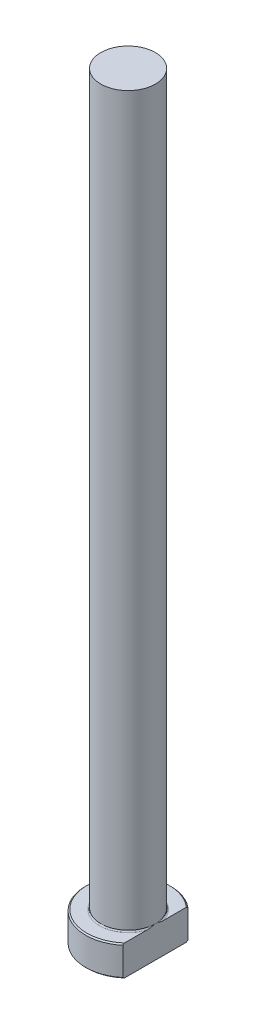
ISO-10303-21;
HEADER;
FILE_DESCRIPTION(('STEP AP214'),'2;1');
FILE_NAME('part.step','',(''),(''),'','','');
FILE_SCHEMA(('AUTOMOTIVE_DESIGN { 1 0 10303 214 1 1 1 1 }'));
ENDSEC;
DATA;
#1=APPLICATION_CONTEXT('core data for automotive mechanical design processes');
#2=APPLICATION_PROTOCOL_DEFINITION('international standard','automotive_design',2000,#1);
#3=PRODUCT_CONTEXT('',#1,'mechanical');
#4=PRODUCT('Part','Part','',(#3));
#5=PRODUCT_RELATED_PRODUCT_CATEGORY('part','',(#4));
#6=PRODUCT_DEFINITION_FORMATION('','',#4);
#7=PRODUCT_DEFINITION_CONTEXT('part definition',#1,'design');
#8=PRODUCT_DEFINITION('design','',#6,#7);
#9=PRODUCT_DEFINITION_SHAPE('','',#8);
#10=(LENGTH_UNIT() NAMED_UNIT(*) SI_UNIT(.MILLI.,.METRE.));
#11=(NAMED_UNIT(*) PLANE_ANGLE_UNIT() SI_UNIT($,.RADIAN.));
#12=(NAMED_UNIT(*) SI_UNIT($,.STERADIAN.) SOLID_ANGLE_UNIT());
#13=UNCERTAINTY_MEASURE_WITH_UNIT(LENGTH_MEASURE(1.E-05),#10,'distance_accuracy_value','');
#14=(GEOMETRIC_REPRESENTATION_CONTEXT(3) GLOBAL_UNCERTAINTY_ASSIGNED_CONTEXT((#13)) GLOBAL_UNIT_ASSIGNED_CONTEXT((#10,
#11,#12)) REPRESENTATION_CONTEXT('',''));
#15=CARTESIAN_POINT('',(0.,0.,0.));
#16=DIRECTION('',(0.,0.,1.));
#17=DIRECTION('',(1.,0.,0.));
#18=AXIS2_PLACEMENT_3D('',#15,#16,#17);
#19=CARTESIAN_POINT('',(0.,0.,0.));
#20=DIRECTION('',(0.,-1.,0.));
#21=DIRECTION('',(0.,0.,-1.));
#22=AXIS2_PLACEMENT_3D('',#19,#20,#21);
#23=PLANE('',#22);
#24=CARTESIAN_POINT('',(0.,0.,0.));
#25=DIRECTION('',(0.,-1.,0.));
#26=DIRECTION('',(0.,0.,-1.));
#27=AXIS2_PLACEMENT_3D('',#24,#25,#26);
#28=CIRCLE('',#27,6.8);
#29=CARTESIAN_POINT('',(4.49999999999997,0.,5.09803883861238));
#30=VERTEX_POINT('',#29);
#31=CARTESIAN_POINT('',(4.49999999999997,0.,-5.09803883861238));
#32=VERTEX_POINT('',#31);
#33=EDGE_CURVE('E98',#30,#32,#28,.T.);
#34=ORIENTED_EDGE('',*,*,#33,.T.);
#35=DIRECTION('',(0.,0.,1.));
#36=VECTOR('',#35,1.);
#37=CARTESIAN_POINT('',(4.49999999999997,0.,-5.36190264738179));
#38=LINE('',#37,#36);
#39=EDGE_CURVE('E83',#32,#30,#38,.T.);
#40=ORIENTED_EDGE('',*,*,#39,.T.);
#41=EDGE_LOOP('',(#34,#40));
#42=FACE_BOUND('',#41,.T.);
#43=ADVANCED_FACE('F32',(#42),#23,.T.);
#44=CARTESIAN_POINT('',(0.,259.958771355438,0.));
#45=DIRECTION('',(0.,1.,0.));
#46=DIRECTION('',(0.,0.,1.));
#47=AXIS2_PLACEMENT_3D('',#44,#45,#46);
#48=CYLINDRICAL_SURFACE('',#47,6.99999999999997);
#49=CARTESIAN_POINT('',(0.,4.80000000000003,0.));
#50=DIRECTION('',(0.,1.,0.));
#51=DIRECTION('',(0.,0.,1.));
#52=AXIS2_PLACEMENT_3D('',#49,#50,#51);
#53=CIRCLE('',#52,6.99999999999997);
#54=CARTESIAN_POINT('',(4.49999999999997,4.80000000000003,5.36190264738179));
#55=VERTEX_POINT('',#54);
#56=CARTESIAN_POINT('',(4.49999999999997,4.80000000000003,-5.36190264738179));
#57=VERTEX_POINT('',#56);
#58=EDGE_CURVE('E104',#55,#57,#53,.F.);
#59=ORIENTED_EDGE('',*,*,#58,.T.);
#60=DIRECTION('',(0.,-1.,0.));
#61=VECTOR('',#60,1.);
#62=CARTESIAN_POINT('',(4.49999999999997,125.,-5.36190264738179));
#63=LINE('',#62,#61);
#64=CARTESIAN_POINT('',(4.49999999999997,0.199999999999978,-5.36190264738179));
#65=VERTEX_POINT('',#64);
#66=EDGE_CURVE('E183',#57,#65,#63,.T.);
#67=ORIENTED_EDGE('',*,*,#66,.T.);
#68=CARTESIAN_POINT('',(0.,0.199999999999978,0.));
#69=DIRECTION('',(0.,-1.,0.));
#70=DIRECTION('',(0.,0.,-1.));
#71=AXIS2_PLACEMENT_3D('',#68,#69,#70);
#72=CIRCLE('',#71,6.99999999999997);
#73=CARTESIAN_POINT('',(4.49999999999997,0.199999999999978,5.36190264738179));
#74=VERTEX_POINT('',#73);
#75=EDGE_CURVE('E100',#65,#74,#72,.F.);
#76=ORIENTED_EDGE('',*,*,#75,.T.);
#77=DIRECTION('',(0.,-1.,0.));
#78=VECTOR('',#77,1.);
#79=CARTESIAN_POINT('',(4.49999999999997,125.,5.36190264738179));
#80=LINE('',#79,#78);
#81=EDGE_CURVE('E93',#55,#74,#80,.T.);
#82=ORIENTED_EDGE('',*,*,#81,.F.);
#83=EDGE_LOOP('',(#59,#67,#76,#82));
#84=FACE_BOUND('',#83,.T.);
#85=ADVANCED_FACE('F158',(#84),#48,.T.);
#86=CARTESIAN_POINT('',(-6.99999999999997,5.,0.));
#87=DIRECTION('',(0.,1.,0.));
#88=DIRECTION('',(0.,0.,1.));
#89=AXIS2_PLACEMENT_3D('',#86,#87,#88);
#90=PLANE('',#89);
#91=CARTESIAN_POINT('',(0.,5.,0.));
#92=DIRECTION('',(0.,1.,0.));
#93=DIRECTION('',(0.,0.,1.));
#94=AXIS2_PLACEMENT_3D('',#91,#92,#93);
#95=CIRCLE('',#94,6.79999999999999);
#96=CARTESIAN_POINT('',(4.49999999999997,5.,-5.09803883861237));
#97=VERTEX_POINT('',#96);
#98=CARTESIAN_POINT('',(4.49999999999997,5.,5.09803883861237));
#99=VERTEX_POINT('',#98);
#100=EDGE_CURVE('E178',#97,#99,#95,.T.);
#101=ORIENTED_EDGE('',*,*,#100,.T.);
#102=DIRECTION('',(0.,0.,-1.));
#103=VECTOR('',#102,1.);
#104=CARTESIAN_POINT('',(4.49999999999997,5.,0.));
#105=LINE('',#104,#103);
#106=CARTESIAN_POINT('',(4.49999999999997,4.99999999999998,1.35646599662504));
#107=VERTEX_POINT('',#106);
#108=EDGE_CURVE('E57',#99,#107,#105,.T.);
#109=ORIENTED_EDGE('',*,*,#108,.T.);
#110=CARTESIAN_POINT('',(0.,5.,0.));
#111=DIRECTION('',(0.,1.,0.));
#112=DIRECTION('',(0.,0.,1.));
#113=AXIS2_PLACEMENT_3D('',#110,#111,#112);
#114=CIRCLE('',#113,4.69999999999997);
#115=CARTESIAN_POINT('',(4.49999999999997,4.99999999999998,-1.35646599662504));
#116=VERTEX_POINT('',#115);
#117=EDGE_CURVE('E107',#107,#116,#114,.F.);
#118=ORIENTED_EDGE('',*,*,#117,.T.);
#119=EDGE_CURVE('E136',#116,#97,#105,.T.);
#120=ORIENTED_EDGE('',*,*,#119,.T.);
#121=EDGE_LOOP('',(#101,#109,#118,#120));
#122=FACE_BOUND('',#121,.T.);
#123=ADVANCED_FACE('F147',(#122),#90,.T.);
#124=CARTESIAN_POINT('',(0.,5.,0.));
#125=DIRECTION('',(0.,-1.,0.));
#126=DIRECTION('',(0.,0.,-1.));
#127=AXIS2_PLACEMENT_3D('',#124,#125,#126);
#128=CONICAL_SURFACE('',#127,6.79999999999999,0.785398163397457);
#129=ORIENTED_EDGE('',*,*,#58,.F.);
#130=CARTESIAN_POINT('',(4.49999999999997,-0.826603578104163,11.7975047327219));
#131=CARTESIAN_POINT('',(4.49999999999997,-0.656533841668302,11.6154797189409));
#132=CARTESIAN_POINT('',(4.49999999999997,-0.486727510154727,11.4332086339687));
#133=CARTESIAN_POINT('',(4.49999999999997,-0.147726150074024,11.0680967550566));
#134=CARTESIAN_POINT('',(4.49999999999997,0.0214688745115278,10.8852559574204));
#135=CARTESIAN_POINT('',(4.49999999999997,0.528086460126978,10.3356799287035));
#136=CARTESIAN_POINT('',(4.49999999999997,0.864461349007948,9.96797672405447));
#137=CARTESIAN_POINT('',(4.49999999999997,1.53592421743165,9.2263884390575));
#138=CARTESIAN_POINT('',(4.49999999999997,1.87098392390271,8.85247771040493));
#139=CARTESIAN_POINT('',(4.49999999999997,2.53567264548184,8.09993899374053));
#140=CARTESIAN_POINT('',(4.49999999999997,2.86530243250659,7.72131168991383));
#141=CARTESIAN_POINT('',(4.49999999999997,3.45461987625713,7.03004475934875));
#142=CARTESIAN_POINT('',(4.49999999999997,3.71567058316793,6.71857295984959));
#143=CARTESIAN_POINT('',(4.49999999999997,4.10171222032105,6.24673895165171));
#144=CARTESIAN_POINT('',(4.49999999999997,4.22949330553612,6.08866046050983));
#145=CARTESIAN_POINT('',(4.49999999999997,4.48278285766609,5.77069538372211));
#146=CARTESIAN_POINT('',(4.49999999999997,4.60829137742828,5.61080884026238));
#147=CARTESIAN_POINT('',(4.49999999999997,4.85630566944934,5.28917357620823));
#148=CARTESIAN_POINT('',(4.49999999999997,4.97881640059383,5.12742868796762));
#149=CARTESIAN_POINT('',(4.49999999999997,5.22038566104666,4.80138722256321));
#150=CARTESIAN_POINT('',(4.49999999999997,5.33944438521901,4.63709079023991));
#151=CARTESIAN_POINT('',(4.49999999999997,5.5731551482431,4.30551121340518));
#152=CARTESIAN_POINT('',(4.49999999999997,5.68780947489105,4.13822968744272));
#153=CARTESIAN_POINT('',(4.49999999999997,5.91154779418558,3.79999593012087));
#154=CARTESIAN_POINT('',(4.49999999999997,6.02063265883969,3.62904427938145));
#155=CARTESIAN_POINT('',(4.49999999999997,6.21658595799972,3.30732260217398));
#156=CARTESIAN_POINT('',(4.49999999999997,6.30440873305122,3.15713645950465));
#157=CARTESIAN_POINT('',(4.49999999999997,6.47332532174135,2.85297503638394));
#158=CARTESIAN_POINT('',(4.49999999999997,6.55441838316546,2.69899933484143));
#159=CARTESIAN_POINT('',(4.49999999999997,6.70797622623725,2.3868718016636));
#160=CARTESIAN_POINT('',(4.49999999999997,6.78044573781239,2.22872231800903));
#161=CARTESIAN_POINT('',(4.49999999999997,6.91445119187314,1.90783021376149));
#162=CARTESIAN_POINT('',(4.49999999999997,6.97598991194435,1.74508877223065));
#163=CARTESIAN_POINT('',(4.49999999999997,7.07411688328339,1.44888794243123));
#164=CARTESIAN_POINT('',(4.49999999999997,7.11323376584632,1.31627139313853));
#165=CARTESIAN_POINT('',(4.49999999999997,7.18128524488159,1.04846462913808));
#166=CARTESIAN_POINT('',(4.49999999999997,7.21022354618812,0.913275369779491));
#167=CARTESIAN_POINT('',(4.49999999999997,7.25649613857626,0.641333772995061));
#168=CARTESIAN_POINT('',(4.49999999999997,7.2738666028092,0.504587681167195));
#169=CARTESIAN_POINT('',(4.49999999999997,7.29619809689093,0.230076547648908));
#170=CARTESIAN_POINT('',(4.49999999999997,7.30115982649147,0.0923115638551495));
#171=CARTESIAN_POINT('',(4.49999999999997,7.29837868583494,-0.183455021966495));
#172=CARTESIAN_POINT('',(4.49999999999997,7.29060196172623,-0.321456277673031));
#173=CARTESIAN_POINT('',(4.49999999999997,7.2627360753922,-0.596199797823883));
#174=CARTESIAN_POINT('',(4.49999999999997,7.24264594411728,-0.732941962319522));
#175=CARTESIAN_POINT('',(4.49999999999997,7.19114637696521,-1.00468961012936));
#176=CARTESIAN_POINT('',(4.49999999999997,7.15970172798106,-1.13968832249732));
#177=CARTESIAN_POINT('',(4.49999999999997,7.0869326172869,-1.4069661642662));
#178=CARTESIAN_POINT('',(4.49999999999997,7.0456076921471,-1.5392451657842));
#179=CARTESIAN_POINT('',(4.49999999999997,6.94926301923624,-1.81615594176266));
#180=CARTESIAN_POINT('',(4.49999999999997,6.8932071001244,-1.96042418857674));
#181=CARTESIAN_POINT('',(4.49999999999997,6.77257673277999,-2.24536359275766));
#182=CARTESIAN_POINT('',(4.49999999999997,6.70799968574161,-2.38603363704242));
#183=CARTESIAN_POINT('',(4.49999999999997,6.57186656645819,-2.66422978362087));
#184=CARTESIAN_POINT('',(4.49999999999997,6.50029866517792,-2.8017500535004));
#185=CARTESIAN_POINT('',(4.49999999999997,6.35162424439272,-3.0737210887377));
#186=CARTESIAN_POINT('',(4.49999999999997,6.27451843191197,-3.20817224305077));
#187=CARTESIAN_POINT('',(4.49999999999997,6.11478562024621,-3.47611571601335));
#188=CARTESIAN_POINT('',(4.49999999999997,6.03209988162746,-3.60957285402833));
#189=CARTESIAN_POINT('',(4.49999999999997,5.86298040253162,-3.87408571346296));
#190=CARTESIAN_POINT('',(4.49999999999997,5.7765465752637,-4.00514137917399));
#191=CARTESIAN_POINT('',(4.49999999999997,5.60069241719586,-4.26503919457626));
#192=CARTESIAN_POINT('',(4.49999999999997,5.51127511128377,-4.39388339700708));
#193=CARTESIAN_POINT('',(4.49999999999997,5.32990145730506,-4.64976494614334));
#194=CARTESIAN_POINT('',(4.49999999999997,5.23794514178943,-4.77680231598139));
#195=CARTESIAN_POINT('',(4.49999999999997,5.02845923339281,-5.061146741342));
#196=CARTESIAN_POINT('',(4.49999999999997,4.91032759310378,-5.21800978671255));
#197=CARTESIAN_POINT('',(4.49999999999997,4.6713726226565,-5.5296750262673));
#198=CARTESIAN_POINT('',(4.49999999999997,4.55054918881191,-5.68447714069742));
#199=CARTESIAN_POINT('',(4.49999999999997,4.18476750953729,-6.14632269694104));
#200=CARTESIAN_POINT('',(4.49999999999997,3.93652718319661,-6.45076612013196));
#201=CARTESIAN_POINT('',(4.49999999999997,3.43375842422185,-7.05492264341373));
#202=CARTESIAN_POINT('',(4.49999999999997,3.17922364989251,-7.35463042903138));
#203=CARTESIAN_POINT('',(4.49999999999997,2.66577175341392,-7.95027689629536));
#204=CARTESIAN_POINT('',(4.49999999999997,2.40685449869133,-8.24621546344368));
#205=CARTESIAN_POINT('',(4.49999999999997,1.90253774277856,-8.81624717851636));
#206=CARTESIAN_POINT('',(4.49999999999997,1.65734104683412,-9.09052019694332));
#207=CARTESIAN_POINT('',(4.49999999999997,1.16472214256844,-9.63707062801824));
#208=CARTESIAN_POINT('',(4.49999999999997,0.917299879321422,-9.90934799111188));
#209=CARTESIAN_POINT('',(4.49999999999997,0.421259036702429,-10.4516873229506));
#210=CARTESIAN_POINT('',(4.49999999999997,0.172644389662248,-10.7217528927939));
#211=CARTESIAN_POINT('',(4.49999999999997,-0.325997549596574,-11.2605533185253));
#212=CARTESIAN_POINT('',(4.49999999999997,-0.576024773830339,-11.5292882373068));
#213=CARTESIAN_POINT('',(4.49999999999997,-0.826603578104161,-11.7975047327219));
#214=B_SPLINE_CURVE_WITH_KNOTS('',3,(#130,#131,#132,#133,#134,#135,#136,#137,#138,#139,#140,
#141,#142,#143,#144,#145,#146,#147,#148,#149,#150,#151,#152,#153,#154,#155,#156,#157,#158,#159,
#160,#161,#162,#163,#164,#165,#166,#167,#168,#169,#170,#171,#172,#173,#174,#175,#176,#177,#178,
#179,#180,#181,#182,#183,#184,#185,#186,#187,#188,#189,#190,#191,#192,#193,#194,#195,#196,#197,
#198,#199,#200,#201,#202,#203,#204,#205,#206,#207,#208,#209,#210,#211,#212,#213),.UNSPECIFIED.,
.F.,.F.,(4,2,2,2,2,2,2,2,2,2,2,2,2,2,2,2,2,2,2,2,2,2,2,2,2,2,2,2,2,2,2,2,2,2,2,2,2,2,2,2,2,4),
(0.,0.747335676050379,1.49467621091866,2.98970927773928,4.49588412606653,6.00184297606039,
7.2209551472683,7.83073509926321,8.44050085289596,9.04917844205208,9.65782160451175,
10.2661442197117,10.8743712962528,11.3961742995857,11.9180355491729,12.4396092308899,
12.9610501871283,13.3755059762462,13.7898107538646,14.2028138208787,14.6157935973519,
15.0298726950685,15.4439843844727,15.859391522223,16.2748181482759,16.738805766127,
17.2029352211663,17.6678640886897,18.1327337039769,18.6036459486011,19.0745691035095,
19.5450285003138,20.0154818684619,20.6045534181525,21.1936476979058,22.3719830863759,
23.5515583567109,24.7311693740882,25.8348416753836,26.9385412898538,28.0397632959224,
29.1409327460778),.UNSPECIFIED.);
#215=EDGE_CURVE('E135',#55,#99,#214,.T.);
#216=ORIENTED_EDGE('',*,*,#215,.T.);
#217=ORIENTED_EDGE('',*,*,#100,.F.);
#218=EDGE_CURVE('E127',#97,#57,#214,.T.);
#219=ORIENTED_EDGE('',*,*,#218,.T.);
#220=EDGE_LOOP('',(#129,#216,#217,#219));
#221=FACE_BOUND('',#220,.T.);
#222=ADVANCED_FACE('F143',(#221),#128,.T.);
#223=CARTESIAN_POINT('',(0.,0.199999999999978,0.));
#224=DIRECTION('',(0.,1.,0.));
#225=DIRECTION('',(0.,0.,1.));
#226=AXIS2_PLACEMENT_3D('',#223,#224,#225);
#227=CONICAL_SURFACE('',#226,6.99999999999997,0.785398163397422);
#228=ORIENTED_EDGE('',*,*,#75,.F.);
#229=CARTESIAN_POINT('',(4.49999999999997,5.82660357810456,-11.7975047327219));
#230=CARTESIAN_POINT('',(4.49999999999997,5.65653384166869,-11.6154797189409));
#231=CARTESIAN_POINT('',(4.49999999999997,5.48672751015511,-11.4332086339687));
#232=CARTESIAN_POINT('',(4.49999999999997,5.1477261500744,-11.0680967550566));
#233=CARTESIAN_POINT('',(4.49999999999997,4.97853112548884,-10.8852559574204));
#234=CARTESIAN_POINT('',(4.49999999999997,4.47191353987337,-10.3356799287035));
#235=CARTESIAN_POINT('',(4.49999999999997,4.13553865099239,-9.96797672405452));
#236=CARTESIAN_POINT('',(4.49999999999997,3.46407578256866,-9.22638843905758));
#237=CARTESIAN_POINT('',(4.49999999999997,3.12901607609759,-8.85247771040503));
#238=CARTESIAN_POINT('',(4.49999999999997,2.46432735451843,-8.09993899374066));
#239=CARTESIAN_POINT('',(4.49999999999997,2.13469756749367,-7.72131168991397));
#240=CARTESIAN_POINT('',(4.49999999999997,1.54538012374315,-7.03004475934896));
#241=CARTESIAN_POINT('',(4.49999999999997,1.28432941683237,-6.71857295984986));
#242=CARTESIAN_POINT('',(4.49999999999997,0.898287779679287,-6.24673895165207));
#243=CARTESIAN_POINT('',(4.49999999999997,0.770506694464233,-6.08866046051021));
#244=CARTESIAN_POINT('',(4.49999999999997,0.517217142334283,-5.77069538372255));
#245=CARTESIAN_POINT('',(4.49999999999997,0.391708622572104,-5.61080884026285));
#246=CARTESIAN_POINT('',(4.49999999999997,0.143694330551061,-5.28917357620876));
#247=CARTESIAN_POINT('',(4.49999999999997,0.0211835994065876,-5.12742868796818));
#248=CARTESIAN_POINT('',(4.49999999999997,-0.220385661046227,-4.80138722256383));
#249=CARTESIAN_POINT('',(4.49999999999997,-0.339444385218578,-4.63709079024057));
#250=CARTESIAN_POINT('',(4.49999999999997,-0.573155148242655,-4.3055112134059));
#251=CARTESIAN_POINT('',(4.49999999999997,-0.687809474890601,-4.13822968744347));
#252=CARTESIAN_POINT('',(4.49999999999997,-0.911547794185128,-3.79999593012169));
#253=CARTESIAN_POINT('',(4.49999999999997,-1.02063265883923,-3.6290442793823));
#254=CARTESIAN_POINT('',(4.49999999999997,-1.21658595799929,-3.30732260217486));
#255=CARTESIAN_POINT('',(4.49999999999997,-1.30440873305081,-3.15713645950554));
#256=CARTESIAN_POINT('',(4.49999999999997,-1.47332532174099,-2.85297503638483));
#257=CARTESIAN_POINT('',(4.49999999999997,-1.55441838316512,-2.69899933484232));
#258=CARTESIAN_POINT('',(4.49999999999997,-1.70797622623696,-2.3868718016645));
#259=CARTESIAN_POINT('',(4.49999999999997,-1.78044573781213,-2.22872231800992));
#260=CARTESIAN_POINT('',(4.49999999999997,-1.91445119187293,-1.90783021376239));
#261=CARTESIAN_POINT('',(4.49999999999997,-1.97598991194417,-1.74508877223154));
#262=CARTESIAN_POINT('',(4.49999999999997,-2.07411688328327,-1.44888794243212));
#263=CARTESIAN_POINT('',(4.49999999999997,-2.11323376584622,-1.31627139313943));
#264=CARTESIAN_POINT('',(4.49999999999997,-2.18128524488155,-1.04846462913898));
#265=CARTESIAN_POINT('',(4.49999999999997,-2.21022354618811,-0.913275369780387));
#266=CARTESIAN_POINT('',(4.49999999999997,-2.2564961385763,-0.641333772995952));
#267=CARTESIAN_POINT('',(4.49999999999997,-2.27386660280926,-0.504587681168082));
#268=CARTESIAN_POINT('',(4.49999999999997,-2.29619809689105,-0.230076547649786));
#269=CARTESIAN_POINT('',(4.49999999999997,-2.30115982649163,-0.0923115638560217));
#270=CARTESIAN_POINT('',(4.49999999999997,-2.29837868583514,0.18345502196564));
#271=CARTESIAN_POINT('',(4.49999999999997,-2.29060196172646,0.321456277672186));
#272=CARTESIAN_POINT('',(4.49999999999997,-2.26273607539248,0.596199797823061));
#273=CARTESIAN_POINT('',(4.49999999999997,-2.24264594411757,0.732941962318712));
#274=CARTESIAN_POINT('',(4.49999999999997,-2.19114637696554,1.00468961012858));
#275=CARTESIAN_POINT('',(4.49999999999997,-2.15970172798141,1.13968832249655));
#276=CARTESIAN_POINT('',(4.49999999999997,-2.08693261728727,1.40696616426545));
#277=CARTESIAN_POINT('',(4.49999999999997,-2.04560769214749,1.53924516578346));
#278=CARTESIAN_POINT('',(4.49999999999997,-1.94926301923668,1.81615594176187));
#279=CARTESIAN_POINT('',(4.49999999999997,-1.89320710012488,1.96042418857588));
#280=CARTESIAN_POINT('',(4.49999999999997,-1.77257673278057,2.24536359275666));
#281=CARTESIAN_POINT('',(4.49999999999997,-1.70799968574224,2.38603363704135));
#282=CARTESIAN_POINT('',(4.49999999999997,-1.57186656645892,2.66422978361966));
#283=CARTESIAN_POINT('',(4.49999999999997,-1.5002986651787,2.80175005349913));
#284=CARTESIAN_POINT('',(4.49999999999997,-1.35162424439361,3.0737210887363));
#285=CARTESIAN_POINT('',(4.49999999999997,-1.27451843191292,3.20817224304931));
#286=CARTESIAN_POINT('',(4.49999999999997,-1.11478562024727,3.47611571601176));
#287=CARTESIAN_POINT('',(4.49999999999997,-1.03209988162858,3.60957285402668));
#288=CARTESIAN_POINT('',(4.49999999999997,-0.862980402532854,3.87408571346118));
#289=CARTESIAN_POINT('',(4.49999999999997,-0.77654657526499,4.00514137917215));
#290=CARTESIAN_POINT('',(4.49999999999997,-0.600692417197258,4.2650391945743));
#291=CARTESIAN_POINT('',(4.49999999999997,-0.511275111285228,4.39388339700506));
#292=CARTESIAN_POINT('',(4.49999999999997,-0.329901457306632,4.64976494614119));
#293=CARTESIAN_POINT('',(4.49999999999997,-0.237945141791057,4.77680231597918));
#294=CARTESIAN_POINT('',(4.49999999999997,-0.0284592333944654,5.06114674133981));
#295=CARTESIAN_POINT('',(4.49999999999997,0.0896724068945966,5.21800978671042));
#296=CARTESIAN_POINT('',(4.49999999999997,0.328627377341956,5.52967502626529));
#297=CARTESIAN_POINT('',(4.49999999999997,0.449450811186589,5.68447714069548));
#298=CARTESIAN_POINT('',(4.49999999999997,0.815232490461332,6.14632269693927));
#299=CARTESIAN_POINT('',(4.49999999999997,1.0634728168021,6.45076612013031));
#300=CARTESIAN_POINT('',(4.49999999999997,1.56624157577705,7.0549226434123));
#301=CARTESIAN_POINT('',(4.49999999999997,1.82077635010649,7.35463042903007));
#302=CARTESIAN_POINT('',(4.49999999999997,2.33422824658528,7.95027689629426));
#303=CARTESIAN_POINT('',(4.49999999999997,2.59314550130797,8.2462154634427));
#304=CARTESIAN_POINT('',(4.49999999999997,3.09746225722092,8.81624717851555));
#305=CARTESIAN_POINT('',(4.49999999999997,3.34265895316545,9.09052019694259));
#306=CARTESIAN_POINT('',(4.49999999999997,3.83527785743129,9.63707062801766));
#307=CARTESIAN_POINT('',(4.49999999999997,4.08270012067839,9.90934799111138));
#308=CARTESIAN_POINT('',(4.49999999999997,4.57874096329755,10.4516873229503));
#309=CARTESIAN_POINT('',(4.49999999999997,4.82735561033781,10.7217528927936));
#310=CARTESIAN_POINT('',(4.49999999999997,5.3259975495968,11.2605533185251));
#311=CARTESIAN_POINT('',(4.49999999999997,5.57602477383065,11.5292882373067));
#312=CARTESIAN_POINT('',(4.49999999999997,5.82660357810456,11.7975047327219));
#313=B_SPLINE_CURVE_WITH_KNOTS('',3,(#229,#230,#231,#232,#233,#234,#235,#236,#237,#238,#239,
#240,#241,#242,#243,#244,#245,#246,#247,#248,#249,#250,#251,#252,#253,#254,#255,#256,#257,#258,
#259,#260,#261,#262,#263,#264,#265,#266,#267,#268,#269,#270,#271,#272,#273,#274,#275,#276,#277,
#278,#279,#280,#281,#282,#283,#284,#285,#286,#287,#288,#289,#290,#291,#292,#293,#294,#295,#296,
#297,#298,#299,#300,#301,#302,#303,#304,#305,#306,#307,#308,#309,#310,#311,#312),.UNSPECIFIED.,
.F.,.F.,(4,2,2,2,2,2,2,2,2,2,2,2,2,2,2,2,2,2,2,2,2,2,2,2,2,2,2,2,2,2,2,2,2,2,2,2,2,2,2,2,2,4),
(0.,0.747335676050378,1.49467621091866,2.98970927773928,4.49588412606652,6.00184297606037,
7.2209551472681,7.83073509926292,8.44050085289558,9.04917844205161,9.6578216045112,
10.266144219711,10.8743712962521,11.396174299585,11.9180355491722,12.4396092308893,
12.9610501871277,13.3755059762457,13.789810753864,14.2028138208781,14.6157935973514,
15.0298726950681,15.4439843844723,15.8593915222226,16.2748181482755,16.7388057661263,
17.2029352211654,17.6678640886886,18.1327337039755,18.6036459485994,19.0745691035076,
19.5450285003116,20.0154818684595,20.6045534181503,21.1936476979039,22.3719830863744,
23.5515583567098,24.7311693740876,25.8348416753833,26.9385412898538,28.0397632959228,
29.1409327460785),.UNSPECIFIED.);
#314=EDGE_CURVE('E86',#65,#32,#313,.T.);
#315=ORIENTED_EDGE('',*,*,#314,.T.);
#316=ORIENTED_EDGE('',*,*,#33,.F.);
#317=EDGE_CURVE('E89',#30,#74,#313,.T.);
#318=ORIENTED_EDGE('',*,*,#317,.T.);
#319=EDGE_LOOP('',(#228,#315,#316,#318));
#320=FACE_BOUND('',#319,.T.);
#321=ADVANCED_FACE('F97',(#320),#227,.T.);
#322=CARTESIAN_POINT('',(0.,5.19999999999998,0.));
#323=DIRECTION('',(0.,1.,0.));
#324=DIRECTION('',(0.,0.,1.));
#325=AXIS2_PLACEMENT_3D('',#322,#323,#324);
#326=TOROIDAL_SURFACE('',#325,4.69999999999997,0.2);
#327=CARTESIAN_POINT('',(4.49999999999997,5.19999999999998,0.));
#328=CARTESIAN_POINT('',(4.49999999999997,5.20000055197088,-6.82190207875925E-09));
#329=CARTESIAN_POINT('',(4.49999999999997,5.20000110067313,-2.8507749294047E-07));
#330=CARTESIAN_POINT('',(4.49999999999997,5.20000211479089,-1.011869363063E-06));
#331=CARTESIAN_POINT('',(4.49999999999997,5.20000255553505,-1.47962814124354E-06));
#332=CARTESIAN_POINT('',(4.49999999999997,5.20000349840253,-2.60944744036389E-06));
#333=CARTESIAN_POINT('',(4.49999999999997,5.2000039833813,-3.28932128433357E-06));
#334=CARTESIAN_POINT('',(4.49999999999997,5.20000482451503,-4.67191774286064E-06));
#335=CARTESIAN_POINT('',(4.49999999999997,5.20000518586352,-5.37183781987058E-06));
#336=CARTESIAN_POINT('',(4.49999999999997,5.2000065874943,-8.170073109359E-06));
#337=CARTESIAN_POINT('',(4.49999999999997,5.2000075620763,-1.03053692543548E-05));
#338=CARTESIAN_POINT('',(4.49999999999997,5.20000909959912,-1.44577153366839E-05));
#339=CARTESIAN_POINT('',(4.49999999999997,5.20000969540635,-1.64630059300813E-05));
#340=CARTESIAN_POINT('',(4.49999999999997,5.20001228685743,-2.51554967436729E-05));
#341=CARTESIAN_POINT('',(4.49999999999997,5.20001430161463,-3.18381715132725E-05));
#342=CARTESIAN_POINT('',(4.49999999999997,5.20001716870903,-4.42838289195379E-05));
#343=CARTESIAN_POINT('',(4.49999999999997,5.20001815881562,-5.00144685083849E-05));
#344=CARTESIAN_POINT('',(4.49999999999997,5.20002543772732,-9.26835273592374E-05));
#345=CARTESIAN_POINT('',(4.49999999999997,5.20003122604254,-0.000129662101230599));
#346=CARTESIAN_POINT('',(4.49999999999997,5.20005596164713,-0.000272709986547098));
#347=CARTESIAN_POINT('',(4.49999999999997,5.20007919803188,-0.00037804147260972));
#348=CARTESIAN_POINT('',(4.49999999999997,5.20016600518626,-0.000777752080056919));
#349=CARTESIAN_POINT('',(4.49999999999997,5.2002271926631,-0.00107246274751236));
#350=CARTESIAN_POINT('',(4.49999999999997,5.20046266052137,-0.00220073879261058));
#351=CARTESIAN_POINT('',(4.49999999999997,5.20063910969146,-0.00303403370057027));
#352=CARTESIAN_POINT('',(4.49999999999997,5.20146807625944,-0.00695397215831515));
#353=CARTESIAN_POINT('',(4.49999999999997,5.20211775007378,-0.0100409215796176));
#354=CARTESIAN_POINT('',(4.49999999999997,5.2104625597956,-0.0496851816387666));
#355=CARTESIAN_POINT('',(4.49999999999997,5.2181721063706,-0.0862414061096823));
#356=CARTESIAN_POINT('',(4.49999999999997,5.23425793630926,-0.163016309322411));
#357=CARTESIAN_POINT('',(4.49999999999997,5.24262411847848,-0.203237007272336));
#358=CARTESIAN_POINT('',(4.49999999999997,5.25647489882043,-0.270691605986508));
#359=CARTESIAN_POINT('',(4.49999999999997,5.26201543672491,-0.297913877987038));
#360=CARTESIAN_POINT('',(4.49999999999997,5.27283497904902,-0.351731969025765));
#361=CARTESIAN_POINT('',(4.49999999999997,5.27811706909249,-0.378327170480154));
#362=CARTESIAN_POINT('',(4.49999999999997,5.29540054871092,-0.466700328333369));
#363=CARTESIAN_POINT('',(4.49999999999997,5.30706090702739,-0.528546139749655));
#364=CARTESIAN_POINT('',(4.49999999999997,5.32919553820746,-0.652993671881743));
#365=CARTESIAN_POINT('',(4.49999999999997,5.33965890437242,-0.715597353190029));
#366=CARTESIAN_POINT('',(4.49999999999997,5.35981150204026,-0.848050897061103));
#367=CARTESIAN_POINT('',(4.49999999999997,5.36928619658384,-0.917934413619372));
#368=CARTESIAN_POINT('',(4.49999999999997,5.38501179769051,-1.05789403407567));
#369=CARTESIAN_POINT('',(4.49999999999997,5.39127087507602,-1.12796919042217));
#370=CARTESIAN_POINT('',(4.49999999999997,5.39912931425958,-1.26576099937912));
#371=CARTESIAN_POINT('',(4.49999999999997,5.40089657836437,-1.33346617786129));
#372=CARTESIAN_POINT('',(4.49999999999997,5.39892238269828,-1.43427893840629));
#373=CARTESIAN_POINT('',(4.49999999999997,5.39752994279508,-1.46742827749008));
#374=CARTESIAN_POINT('',(4.49999999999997,5.39286046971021,-1.53357775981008));
#375=CARTESIAN_POINT('',(4.49999999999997,5.38958468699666,-1.56657798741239));
#376=CARTESIAN_POINT('',(4.49999999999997,5.38053340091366,-1.63263406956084));
#377=CARTESIAN_POINT('',(4.49999999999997,5.37473096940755,-1.66568659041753));
#378=CARTESIAN_POINT('',(4.49999999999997,5.363351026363,-1.71471614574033));
#379=CARTESIAN_POINT('',(4.49999999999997,5.35910046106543,-1.73099981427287));
#380=CARTESIAN_POINT('',(4.49999999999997,5.34948134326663,-1.76322922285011));
#381=CARTESIAN_POINT('',(4.49999999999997,5.34411369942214,-1.77917522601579));
#382=CARTESIAN_POINT('',(4.49999999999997,5.33191498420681,-1.81057972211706));
#383=CARTESIAN_POINT('',(4.49999999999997,5.32507796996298,-1.82603593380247));
#384=CARTESIAN_POINT('',(4.49999999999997,5.30945990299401,-1.85590044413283));
#385=CARTESIAN_POINT('',(4.49999999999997,5.3006900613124,-1.87031417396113));
#386=CARTESIAN_POINT('',(4.49999999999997,5.28636937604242,-1.88912645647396));
#387=CARTESIAN_POINT('',(4.49999999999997,5.28198345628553,-1.89440539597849));
#388=CARTESIAN_POINT('',(4.49999999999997,5.27265048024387,-1.90446776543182));
#389=CARTESIAN_POINT('',(4.49999999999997,5.26770253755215,-1.90925038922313));
#390=CARTESIAN_POINT('',(4.49999999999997,5.25711045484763,-1.91814546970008));
#391=CARTESIAN_POINT('',(4.49999999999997,5.25145790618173,-1.92224813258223));
#392=CARTESIAN_POINT('',(4.49999999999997,5.23949451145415,-1.92934216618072));
#393=CARTESIAN_POINT('',(4.49999999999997,5.23318629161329,-1.93233776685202));
#394=CARTESIAN_POINT('',(4.49999999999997,5.22225980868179,-1.93605363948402));
#395=CARTESIAN_POINT('',(4.49999999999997,5.21778688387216,-1.93720033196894));
#396=CARTESIAN_POINT('',(4.49999999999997,5.20871133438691,-1.93872266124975));
#397=CARTESIAN_POINT('',(4.49999999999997,5.20410881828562,-1.9390989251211));
#398=CARTESIAN_POINT('',(4.49999999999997,5.19490368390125,-1.939041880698));
#399=CARTESIAN_POINT('',(4.49999999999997,5.19030107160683,-1.93860763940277));
#400=CARTESIAN_POINT('',(4.49999999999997,5.18123418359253,-1.93697295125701));
#401=CARTESIAN_POINT('',(4.49999999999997,5.17677002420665,-1.93577187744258));
#402=CARTESIAN_POINT('',(4.49999999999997,5.1668471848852,-1.93227382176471));
#403=CARTESIAN_POINT('',(4.49999999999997,5.16146458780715,-1.92976289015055));
#404=CARTESIAN_POINT('',(4.49999999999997,5.15117210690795,-1.92391275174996));
#405=CARTESIAN_POINT('',(4.49999999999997,5.1462632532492,-1.92057179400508));
#406=CARTESIAN_POINT('',(4.49999999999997,5.13406500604,-1.91106955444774));
#407=CARTESIAN_POINT('',(4.49999999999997,5.1271509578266,-1.90443135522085));
#408=CARTESIAN_POINT('',(4.49999999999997,5.1143641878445,-1.89022781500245));
#409=CARTESIAN_POINT('',(4.49999999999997,5.10849431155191,-1.88266003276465));
#410=CARTESIAN_POINT('',(4.49999999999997,5.09196345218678,-1.85885313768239));
#411=CARTESIAN_POINT('',(4.49999999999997,5.08260528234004,-1.84172098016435));
#412=CARTESIAN_POINT('',(4.49999999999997,5.0661847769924,-1.80641645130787));
#413=CARTESIAN_POINT('',(4.49999999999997,5.05912924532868,-1.78824118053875));
#414=CARTESIAN_POINT('',(4.49999999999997,5.04323663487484,-1.74113187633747));
#415=CARTESIAN_POINT('',(4.49999999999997,5.03557186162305,-1.7118061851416));
#416=CARTESIAN_POINT('',(4.49999999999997,5.02293045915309,-1.6525641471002));
#417=CARTESIAN_POINT('',(4.49999999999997,5.01795986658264,-1.62264662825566));
#418=CARTESIAN_POINT('',(4.49999999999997,5.01001791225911,-1.56241066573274));
#419=CARTESIAN_POINT('',(4.49999999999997,5.00705603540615,-1.53209099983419));
#420=CARTESIAN_POINT('',(4.49999999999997,5.00272853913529,-1.4713805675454));
#421=CARTESIAN_POINT('',(4.49999999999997,5.00136115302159,-1.44098991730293));
#422=CARTESIAN_POINT('',(4.49999999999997,4.99922532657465,-1.3517640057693));
#423=CARTESIAN_POINT('',(4.49999999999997,5.00021079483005,-1.29288773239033));
#424=CARTESIAN_POINT('',(4.49999999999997,5.00555979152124,-1.17527759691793));
#425=CARTESIAN_POINT('',(4.49999999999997,5.0099258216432,-1.11654387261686));
#426=CARTESIAN_POINT('',(4.49999999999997,5.02118223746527,-0.999199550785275));
#427=CARTESIAN_POINT('',(4.49999999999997,5.02807797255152,-0.940589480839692));
#428=CARTESIAN_POINT('',(4.49999999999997,5.04376271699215,-0.823619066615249));
#429=CARTESIAN_POINT('',(4.49999999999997,5.05255207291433,-0.765258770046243));
#430=CARTESIAN_POINT('',(4.49999999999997,5.08097305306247,-0.59074120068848));
#431=CARTESIAN_POINT('',(4.49999999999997,5.10268261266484,-0.474928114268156));
#432=CARTESIAN_POINT('',(4.49999999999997,5.14864719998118,-0.243827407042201));
#433=CARTESIAN_POINT('',(4.49999999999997,5.1729024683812,-0.128539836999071));
#434=CARTESIAN_POINT('',(4.49999999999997,5.19721381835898,-0.013216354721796));
#435=CARTESIAN_POINT('',(4.49999999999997,5.19722314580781,-0.0131721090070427));
#436=CARTESIAN_POINT('',(4.49999999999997,5.19779043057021,-0.0104809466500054));
#437=CARTESIAN_POINT('',(4.49999999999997,5.19834611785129,-0.00783370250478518));
#438=CARTESIAN_POINT('',(4.49999999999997,5.19915446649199,-0.00401576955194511));
#439=CARTESIAN_POINT('',(4.49999999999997,5.19940338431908,-0.00284453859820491));
#440=CARTESIAN_POINT('',(4.49999999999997,5.19972657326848,-0.00129224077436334));
#441=CARTESIAN_POINT('',(4.49999999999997,5.19980524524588,-0.000911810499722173));
#442=CARTESIAN_POINT('',(4.49999999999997,5.19991316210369,-0.000412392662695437));
#443=CARTESIAN_POINT('',(4.49999999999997,5.199939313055,-0.000292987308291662));
#444=CARTESIAN_POINT('',(4.49999999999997,5.19996676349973,-0.000133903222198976));
#445=CARTESIAN_POINT('',(4.49999999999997,5.19997289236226,-9.50488513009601E-05));
#446=CARTESIAN_POINT('',(4.49999999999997,5.19998085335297,-5.04499399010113E-05));
#447=CARTESIAN_POINT('',(4.49999999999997,5.19998191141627,-4.46245658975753E-05));
#448=CARTESIAN_POINT('',(4.49999999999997,5.19998498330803,-3.19756841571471E-05));
#449=CARTESIAN_POINT('',(4.49999999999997,5.19998714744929,-2.518933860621E-05));
#450=CARTESIAN_POINT('',(4.49999999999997,5.19998992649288,-1.63868871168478E-05));
#451=CARTESIAN_POINT('',(4.49999999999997,5.19999055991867,-1.43745410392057E-05));
#452=CARTESIAN_POINT('',(4.49999999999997,5.19999218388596,-1.02133648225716E-05));
#453=CARTESIAN_POINT('',(4.49999999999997,5.19999320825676,-8.07729849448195E-06));
#454=CARTESIAN_POINT('',(4.49999999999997,5.19999467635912,-5.28414581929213E-06));
#455=CARTESIAN_POINT('',(4.49999999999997,5.19999505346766,-4.58771677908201E-06));
#456=CARTESIAN_POINT('',(4.49999999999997,5.19999592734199,-3.21494462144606E-06));
#457=CARTESIAN_POINT('',(4.49999999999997,5.19999642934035,-2.5415638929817E-06));
#458=CARTESIAN_POINT('',(4.49999999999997,5.19999740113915,-1.42657027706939E-06));
#459=CARTESIAN_POINT('',(4.49999999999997,5.19999785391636,-9.66495650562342E-07));
#460=CARTESIAN_POINT('',(4.49999999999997,5.19999888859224,-2.59794050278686E-07));
#461=CARTESIAN_POINT('',(4.49999999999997,5.19999944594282,6.84768658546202E-09));
#462=CARTESIAN_POINT('',(4.49999999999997,5.19999999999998,0.));
#463=B_SPLINE_CURVE_WITH_KNOTS('',3,(#327,#328,#329,#330,#331,#332,#333,#334,#335,#336,#337,
#338,#339,#340,#341,#342,#343,#344,#345,#346,#347,#348,#349,#350,#351,#352,#353,#354,#355,#356,
#357,#358,#359,#360,#361,#362,#363,#364,#365,#366,#367,#368,#369,#370,#371,#372,#373,#374,#375,
#376,#377,#378,#379,#380,#381,#382,#383,#384,#385,#386,#387,#388,#389,#390,#391,#392,#393,#394,
#395,#396,#397,#398,#399,#400,#401,#402,#403,#404,#405,#406,#407,#408,#409,#410,#411,#412,#413,
#414,#415,#416,#417,#418,#419,#420,#421,#422,#423,#424,#425,#426,#427,#428,#429,#430,#431,#432,
#433,#434,#435,#436,#437,#438,#439,#440,#441,#442,#443,#444,#445,#446,#447,#448,#449,#450,#451,
#452,#453,#454,#455,#456,#457,#458,#459,#460,#461,#462),.UNSPECIFIED.,.T.,.F.,(4,2,2,2,2,2,2,2,
2,2,2,2,2,2,2,2,2,2,2,2,2,2,2,2,2,2,2,2,2,2,2,2,2,2,2,2,2,2,2,2,2,2,2,2,2,2,2,2,2,2,2,2,2,2,2,2,
2,2,2,2,2,2,2,2,2,2,2,4),(0.,1.69150264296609E-06,3.63558631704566E-06,6.12166225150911E-06,
8.48452135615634E-06,1.55048842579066E-05,2.17748008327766E-05,4.26896425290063E-05,
6.01187537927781E-05,0.000172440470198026,0.000495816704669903,0.00139901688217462,
0.00395409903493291,0.0134181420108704,0.125496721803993,0.248741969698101,0.332082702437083,
0.413426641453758,0.602223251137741,0.792622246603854,1.00413639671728,1.21511040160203,
1.4180738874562,1.51756782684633,1.61699578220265,1.71751038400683,1.76796997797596,
1.81838868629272,1.86901528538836,1.9193556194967,1.9399151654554,1.96050759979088,
1.98137480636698,2.0021614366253,2.01595568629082,2.0297387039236,2.04353759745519,
2.05734778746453,2.0750662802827,2.0928224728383,2.12141432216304,2.1500829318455,
2.20832061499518,2.26672885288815,2.35743544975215,2.44834445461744,2.53967978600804,
2.63091382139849,2.80740805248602,2.98403301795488,3.1610336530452,3.33806671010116,
3.69147200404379,4.04491074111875,4.04504639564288,4.0531616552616,4.0567534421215,
4.05791916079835,4.0582856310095,4.05840367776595,4.058421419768,4.0584427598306,
4.05844908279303,4.05845616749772,4.05845854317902,4.05846104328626,4.05846299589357,
4.05846469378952),.UNSPECIFIED.);
#464=CARTESIAN_POINT('',(4.49999999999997,5.19999999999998,0.));
#465=VERTEX_POINT('',#464);
#466=EDGE_CURVE('E11',#116,#465,#463,.T.);
#467=ORIENTED_EDGE('',*,*,#466,.F.);
#468=ORIENTED_EDGE('',*,*,#117,.F.);
#469=CARTESIAN_POINT('',(4.49999999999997,5.19999999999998,0.));
#470=CARTESIAN_POINT('',(4.49999999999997,5.19999944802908,6.82190212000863E-09));
#471=CARTESIAN_POINT('',(4.49999999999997,5.19999889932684,2.85077492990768E-07));
#472=CARTESIAN_POINT('',(4.49999999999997,5.19999788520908,1.01186936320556E-06));
#473=CARTESIAN_POINT('',(4.49999999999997,5.19999744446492,1.47962814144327E-06));
#474=CARTESIAN_POINT('',(4.49999999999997,5.19999650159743,2.60944744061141E-06));
#475=CARTESIAN_POINT('',(4.49999999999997,5.19999601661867,3.28932128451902E-06));
#476=CARTESIAN_POINT('',(4.49999999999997,5.19999517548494,4.6719177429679E-06));
#477=CARTESIAN_POINT('',(4.49999999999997,5.19999481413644,5.3718378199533E-06));
#478=CARTESIAN_POINT('',(4.49999999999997,5.19999341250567,8.17007310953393E-06));
#479=CARTESIAN_POINT('',(4.49999999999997,5.19999243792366,1.03053692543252E-05));
#480=CARTESIAN_POINT('',(4.49999999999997,5.19999090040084,1.44577153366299E-05));
#481=CARTESIAN_POINT('',(4.49999999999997,5.19999030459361,1.64630059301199E-05));
#482=CARTESIAN_POINT('',(4.49999999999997,5.19998771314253,2.51554967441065E-05));
#483=CARTESIAN_POINT('',(4.49999999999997,5.19998569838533,3.18381715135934E-05));
#484=CARTESIAN_POINT('',(4.49999999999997,5.19998283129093,4.42838289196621E-05));
#485=CARTESIAN_POINT('',(4.49999999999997,5.19998184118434,5.0014468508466E-05));
#486=CARTESIAN_POINT('',(4.49999999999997,5.19997456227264,9.2683527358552E-05));
#487=CARTESIAN_POINT('',(4.49999999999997,5.19996877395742,0.000129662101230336));
#488=CARTESIAN_POINT('',(4.49999999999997,5.19994403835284,0.000272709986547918));
#489=CARTESIAN_POINT('',(4.49999999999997,5.19992080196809,0.000378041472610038));
#490=CARTESIAN_POINT('',(4.49999999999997,5.1998339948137,0.000777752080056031));
#491=CARTESIAN_POINT('',(4.49999999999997,5.19977280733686,0.00107246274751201));
#492=CARTESIAN_POINT('',(4.49999999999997,5.1995373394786,0.00220073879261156));
#493=CARTESIAN_POINT('',(4.49999999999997,5.1993608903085,0.00303403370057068));
#494=CARTESIAN_POINT('',(4.49999999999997,5.19853192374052,0.00695397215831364));
#495=CARTESIAN_POINT('',(4.49999999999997,5.19788224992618,0.0100409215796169));
#496=CARTESIAN_POINT('',(4.49999999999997,5.18953744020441,0.0496851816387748));
#497=CARTESIAN_POINT('',(4.49999999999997,5.18182789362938,0.0862414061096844));
#498=CARTESIAN_POINT('',(4.49999999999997,5.16574206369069,0.163016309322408));
#499=CARTESIAN_POINT('',(4.49999999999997,5.15737588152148,0.203237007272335));
#500=CARTESIAN_POINT('',(4.49999999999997,5.14352510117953,0.270691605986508));
#501=CARTESIAN_POINT('',(4.49999999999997,5.13798456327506,0.297913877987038));
#502=CARTESIAN_POINT('',(4.49999999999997,5.12716502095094,0.351731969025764));
#503=CARTESIAN_POINT('',(4.49999999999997,5.12188293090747,0.378327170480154));
#504=CARTESIAN_POINT('',(4.49999999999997,5.10459945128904,0.466700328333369));
#505=CARTESIAN_POINT('',(4.49999999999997,5.09293909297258,0.528546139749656));
#506=CARTESIAN_POINT('',(4.49999999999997,5.0708044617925,0.652993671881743));
#507=CARTESIAN_POINT('',(4.49999999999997,5.06034109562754,0.715597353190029));
#508=CARTESIAN_POINT('',(4.49999999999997,5.0401884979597,0.848050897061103));
#509=CARTESIAN_POINT('',(4.49999999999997,5.03071380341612,0.917934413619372));
#510=CARTESIAN_POINT('',(4.49999999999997,5.01498820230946,1.05789403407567));
#511=CARTESIAN_POINT('',(4.49999999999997,5.00872912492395,1.12796919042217));
#512=CARTESIAN_POINT('',(4.49999999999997,5.00087068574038,1.26576099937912));
#513=CARTESIAN_POINT('',(4.49999999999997,4.9991034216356,1.33346617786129));
#514=CARTESIAN_POINT('',(4.49999999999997,5.00107761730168,1.43427893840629));
#515=CARTESIAN_POINT('',(4.49999999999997,5.00247005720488,1.46742827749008));
#516=CARTESIAN_POINT('',(4.49999999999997,5.00713953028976,1.53357775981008));
#517=CARTESIAN_POINT('',(4.49999999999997,5.0104153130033,1.56657798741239));
#518=CARTESIAN_POINT('',(4.49999999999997,5.0194665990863,1.63263406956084));
#519=CARTESIAN_POINT('',(4.49999999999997,5.02526903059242,1.66568659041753));
#520=CARTESIAN_POINT('',(4.49999999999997,5.03664897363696,1.71471614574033));
#521=CARTESIAN_POINT('',(4.49999999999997,5.04089953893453,1.73099981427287));
#522=CARTESIAN_POINT('',(4.49999999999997,5.05051865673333,1.76322922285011));
#523=CARTESIAN_POINT('',(4.49999999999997,5.05588630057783,1.77917522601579));
#524=CARTESIAN_POINT('',(4.49999999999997,5.06808501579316,1.81057972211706));
#525=CARTESIAN_POINT('',(4.49999999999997,5.07492203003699,1.82603593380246));
#526=CARTESIAN_POINT('',(4.49999999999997,5.09054009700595,1.85590044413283));
#527=CARTESIAN_POINT('',(4.49999999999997,5.09930993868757,1.87031417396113));
#528=CARTESIAN_POINT('',(4.49999999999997,5.11363062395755,1.88912645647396));
#529=CARTESIAN_POINT('',(4.49999999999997,5.11801654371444,1.89440539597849));
#530=CARTESIAN_POINT('',(4.49999999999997,5.12734951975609,1.90446776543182));
#531=CARTESIAN_POINT('',(4.49999999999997,5.13229746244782,1.90925038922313));
#532=CARTESIAN_POINT('',(4.49999999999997,5.14288954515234,1.91814546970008));
#533=CARTESIAN_POINT('',(4.49999999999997,5.14854209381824,1.92224813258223));
#534=CARTESIAN_POINT('',(4.49999999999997,5.16050548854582,1.92934216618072));
#535=CARTESIAN_POINT('',(4.49999999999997,5.16681370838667,1.93233776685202));
#536=CARTESIAN_POINT('',(4.49999999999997,5.17774019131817,1.93605363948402));
#537=CARTESIAN_POINT('',(4.49999999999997,5.18221311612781,1.93720033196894));
#538=CARTESIAN_POINT('',(4.49999999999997,5.19128866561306,1.93872266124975));
#539=CARTESIAN_POINT('',(4.49999999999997,5.19589118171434,1.9390989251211));
#540=CARTESIAN_POINT('',(4.49999999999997,5.20509631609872,1.939041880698));
#541=CARTESIAN_POINT('',(4.49999999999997,5.20969892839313,1.93860763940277));
#542=CARTESIAN_POINT('',(4.49999999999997,5.21876581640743,1.93697295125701));
#543=CARTESIAN_POINT('',(4.49999999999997,5.22322997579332,1.93577187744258));
#544=CARTESIAN_POINT('',(4.49999999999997,5.23315281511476,1.93227382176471));
#545=CARTESIAN_POINT('',(4.49999999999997,5.23853541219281,1.92976289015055));
#546=CARTESIAN_POINT('',(4.49999999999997,5.24882789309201,1.92391275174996));
#547=CARTESIAN_POINT('',(4.49999999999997,5.25373674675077,1.92057179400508));
#548=CARTESIAN_POINT('',(4.49999999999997,5.26593499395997,1.91106955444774));
#549=CARTESIAN_POINT('',(4.49999999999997,5.27284904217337,1.90443135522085));
#550=CARTESIAN_POINT('',(4.49999999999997,5.28563581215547,1.89022781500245));
#551=CARTESIAN_POINT('',(4.49999999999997,5.29150568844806,1.88266003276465));
#552=CARTESIAN_POINT('',(4.49999999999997,5.30803654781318,1.85885313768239));
#553=CARTESIAN_POINT('',(4.49999999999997,5.31739471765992,1.84172098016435));
#554=CARTESIAN_POINT('',(4.49999999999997,5.33381522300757,1.80641645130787));
#555=CARTESIAN_POINT('',(4.49999999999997,5.34087075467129,1.78824118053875));
#556=CARTESIAN_POINT('',(4.49999999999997,5.35676336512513,1.74113187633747));
#557=CARTESIAN_POINT('',(4.49999999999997,5.36442813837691,1.7118061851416));
#558=CARTESIAN_POINT('',(4.49999999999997,5.37706954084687,1.6525641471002));
#559=CARTESIAN_POINT('',(4.49999999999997,5.38204013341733,1.62264662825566));
#560=CARTESIAN_POINT('',(4.49999999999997,5.38998208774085,1.56241066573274));
#561=CARTESIAN_POINT('',(4.49999999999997,5.39294396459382,1.53209099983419));
#562=CARTESIAN_POINT('',(4.49999999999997,5.39727146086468,1.4713805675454));
#563=CARTESIAN_POINT('',(4.49999999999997,5.39863884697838,1.44098991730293));
#564=CARTESIAN_POINT('',(4.49999999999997,5.40077467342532,1.3517640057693));
#565=CARTESIAN_POINT('',(4.49999999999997,5.39978920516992,1.29288773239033));
#566=CARTESIAN_POINT('',(4.49999999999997,5.39444020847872,1.17527759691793));
#567=CARTESIAN_POINT('',(4.49999999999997,5.39007417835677,1.11654387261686));
#568=CARTESIAN_POINT('',(4.49999999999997,5.37881776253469,0.999199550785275));
#569=CARTESIAN_POINT('',(4.49999999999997,5.37192202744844,0.940589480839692));
#570=CARTESIAN_POINT('',(4.49999999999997,5.35623728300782,0.823619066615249));
#571=CARTESIAN_POINT('',(4.49999999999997,5.34744792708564,0.765258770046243));
#572=CARTESIAN_POINT('',(4.49999999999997,5.31902694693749,0.590741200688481));
#573=CARTESIAN_POINT('',(4.49999999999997,5.29731738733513,0.474928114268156));
#574=CARTESIAN_POINT('',(4.49999999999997,5.25135280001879,0.243827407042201));
#575=CARTESIAN_POINT('',(4.49999999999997,5.22709753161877,0.128539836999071));
#576=CARTESIAN_POINT('',(4.49999999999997,5.20278618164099,0.013216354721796));
#577=CARTESIAN_POINT('',(4.49999999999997,5.20277685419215,0.0131721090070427));
#578=CARTESIAN_POINT('',(4.49999999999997,5.20220956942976,0.0104809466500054));
#579=CARTESIAN_POINT('',(4.49999999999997,5.20165388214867,0.00783370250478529));
#580=CARTESIAN_POINT('',(4.49999999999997,5.20084553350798,0.00401576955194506));
#581=CARTESIAN_POINT('',(4.49999999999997,5.20059661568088,0.00284453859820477));
#582=CARTESIAN_POINT('',(4.49999999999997,5.20027342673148,0.00129224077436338));
#583=CARTESIAN_POINT('',(4.49999999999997,5.20019475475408,0.000911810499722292));
#584=CARTESIAN_POINT('',(4.49999999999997,5.20008683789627,0.000412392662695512));
#585=CARTESIAN_POINT('',(4.49999999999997,5.20006068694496,0.000292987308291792));
#586=CARTESIAN_POINT('',(4.49999999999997,5.20003323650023,0.000133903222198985));
#587=CARTESIAN_POINT('',(4.49999999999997,5.20002710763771,9.50488513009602E-05));
#588=CARTESIAN_POINT('',(4.49999999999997,5.20001914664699,5.04499399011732E-05));
#589=CARTESIAN_POINT('',(4.49999999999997,5.2000180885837,4.46245658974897E-05));
#590=CARTESIAN_POINT('',(4.49999999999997,5.20001501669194,3.19756841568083E-05));
#591=CARTESIAN_POINT('',(4.49999999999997,5.20001285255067,2.51893386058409E-05));
#592=CARTESIAN_POINT('',(4.49999999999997,5.20001007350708,1.63868871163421E-05));
#593=CARTESIAN_POINT('',(4.49999999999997,5.2000094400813,1.43745410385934E-05));
#594=CARTESIAN_POINT('',(4.49999999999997,5.200007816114,1.02133648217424E-05));
#595=CARTESIAN_POINT('',(4.49999999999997,5.2000067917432,8.07729849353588E-06));
#596=CARTESIAN_POINT('',(4.49999999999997,5.20000532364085,5.28414581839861E-06));
#597=CARTESIAN_POINT('',(4.49999999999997,5.2000049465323,4.5877167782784E-06));
#598=CARTESIAN_POINT('',(4.49999999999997,5.20000407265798,3.21494462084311E-06));
#599=CARTESIAN_POINT('',(4.49999999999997,5.20000357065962,2.54156389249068E-06));
#600=CARTESIAN_POINT('',(4.49999999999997,5.20000259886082,1.42657027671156E-06));
#601=CARTESIAN_POINT('',(4.49999999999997,5.20000214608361,9.66495650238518E-07));
#602=CARTESIAN_POINT('',(4.49999999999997,5.20000111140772,2.59794050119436E-07));
#603=CARTESIAN_POINT('',(4.49999999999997,5.20000055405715,-6.8476866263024E-09));
#604=CARTESIAN_POINT('',(4.49999999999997,5.19999999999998,0.));
#605=B_SPLINE_CURVE_WITH_KNOTS('',3,(#469,#470,#471,#472,#473,#474,#475,#476,#477,#478,#479,
#480,#481,#482,#483,#484,#485,#486,#487,#488,#489,#490,#491,#492,#493,#494,#495,#496,#497,#498,
#499,#500,#501,#502,#503,#504,#505,#506,#507,#508,#509,#510,#511,#512,#513,#514,#515,#516,#517,
#518,#519,#520,#521,#522,#523,#524,#525,#526,#527,#528,#529,#530,#531,#532,#533,#534,#535,#536,
#537,#538,#539,#540,#541,#542,#543,#544,#545,#546,#547,#548,#549,#550,#551,#552,#553,#554,#555,
#556,#557,#558,#559,#560,#561,#562,#563,#564,#565,#566,#567,#568,#569,#570,#571,#572,#573,#574,
#575,#576,#577,#578,#579,#580,#581,#582,#583,#584,#585,#586,#587,#588,#589,#590,#591,#592,#593,
#594,#595,#596,#597,#598,#599,#600,#601,#602,#603,#604),.UNSPECIFIED.,.T.,.F.,(4,2,2,2,2,2,2,2,
2,2,2,2,2,2,2,2,2,2,2,2,2,2,2,2,2,2,2,2,2,2,2,2,2,2,2,2,2,2,2,2,2,2,2,2,2,2,2,2,2,2,2,2,2,2,2,2,
2,2,2,2,2,2,2,2,2,2,2,4),(0.,1.69150264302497E-06,3.63558631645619E-06,6.12166225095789E-06,
8.48452135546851E-06,1.55048842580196E-05,2.17748008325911E-05,4.26896425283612E-05,
6.01187537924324E-05,0.000172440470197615,0.000495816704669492,0.00139901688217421,
0.0039540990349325,0.01341814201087,0.125496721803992,0.2487419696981,0.332082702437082,
0.413426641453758,0.602223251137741,0.792622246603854,1.00413639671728,1.21511040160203,
1.4180738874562,1.51756782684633,1.61699578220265,1.71751038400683,1.76796997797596,
1.81838868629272,1.86901528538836,1.9193556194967,1.9399151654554,1.96050759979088,
1.98137480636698,2.0021614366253,2.01595568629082,2.0297387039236,2.04353759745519,
2.05734778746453,2.0750662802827,2.0928224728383,2.12141432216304,2.1500829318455,
2.20832061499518,2.26672885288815,2.35743544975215,2.44834445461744,2.53967978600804,
2.63091382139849,2.80740805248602,2.98403301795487,3.1610336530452,3.33806671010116,
3.69147200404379,4.04491074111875,4.04504639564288,4.05316165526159,4.0567534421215,
4.05791916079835,4.0582856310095,4.05840367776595,4.058421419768,4.0584427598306,
4.05844908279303,4.05845616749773,4.05845854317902,4.05846104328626,4.05846299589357,
4.05846469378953),.UNSPECIFIED.);
#606=EDGE_CURVE('E46',#465,#107,#605,.T.);
#607=ORIENTED_EDGE('',*,*,#606,.F.);
#608=CARTESIAN_POINT('',(0.,5.19999999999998,0.));
#609=DIRECTION('',(0.,1.,0.));
#610=DIRECTION('',(0.,0.,1.));
#611=AXIS2_PLACEMENT_3D('',#608,#609,#610);
#612=CIRCLE('',#611,4.49999999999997);
#613=EDGE_CURVE('E103',#465,#465,#612,.T.);
#614=ORIENTED_EDGE('',*,*,#613,.F.);
#615=EDGE_LOOP('',(#467,#468,#607,#614));
#616=FACE_BOUND('',#615,.T.);
#617=ADVANCED_FACE('F34',(#616),#326,.F.);
#618=CARTESIAN_POINT('',(0.,259.958771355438,0.));
#619=DIRECTION('',(0.,1.,0.));
#620=DIRECTION('',(0.,0.,1.));
#621=AXIS2_PLACEMENT_3D('',#618,#619,#620);
#622=CYLINDRICAL_SURFACE('',#621,4.49999999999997);
#623=ORIENTED_EDGE('',*,*,#613,.T.);
#624=EDGE_LOOP('',(#623));
#625=FACE_BOUND('',#624,.T.);
#626=CARTESIAN_POINT('',(0.,125.,0.));
#627=DIRECTION('',(0.,1.,0.));
#628=DIRECTION('',(0.,0.,1.));
#629=AXIS2_PLACEMENT_3D('',#626,#627,#628);
#630=CIRCLE('',#629,4.49999999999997);
#631=CARTESIAN_POINT('',(0.,125.,4.49999999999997));
#632=VERTEX_POINT('',#631);
#633=EDGE_CURVE('E101',#632,#632,#630,.T.);
#634=ORIENTED_EDGE('',*,*,#633,.F.);
#635=EDGE_LOOP('',(#634));
#636=FACE_BOUND('',#635,.T.);
#637=ADVANCED_FACE('F155',(#625,#636),#622,.T.);
#638=CARTESIAN_POINT('',(-4.49999999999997,125.,0.));
#639=DIRECTION('',(0.,1.,0.));
#640=DIRECTION('',(0.,0.,1.));
#641=AXIS2_PLACEMENT_3D('',#638,#639,#640);
#642=PLANE('',#641);
#643=ORIENTED_EDGE('',*,*,#633,.T.);
#644=EDGE_LOOP('',(#643));
#645=FACE_BOUND('',#644,.T.);
#646=ADVANCED_FACE('F121',(#645),#642,.T.);
#647=CARTESIAN_POINT('',(4.49999999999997,125.,-5.36190264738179));
#648=DIRECTION('',(1.,0.,0.));
#649=DIRECTION('',(0.,0.,-1.));
#650=AXIS2_PLACEMENT_3D('',#647,#648,#649);
#651=PLANE('',#650);
#652=ORIENTED_EDGE('',*,*,#66,.F.);
#653=ORIENTED_EDGE('',*,*,#218,.F.);
#654=ORIENTED_EDGE('',*,*,#119,.F.);
#655=ORIENTED_EDGE('',*,*,#466,.T.);
#656=ORIENTED_EDGE('',*,*,#606,.T.);
#657=ORIENTED_EDGE('',*,*,#108,.F.);
#658=ORIENTED_EDGE('',*,*,#215,.F.);
#659=ORIENTED_EDGE('',*,*,#81,.T.);
#660=ORIENTED_EDGE('',*,*,#317,.F.);
#661=ORIENTED_EDGE('',*,*,#39,.F.);
#662=ORIENTED_EDGE('',*,*,#314,.F.);
#663=EDGE_LOOP('',(#652,#653,#654,#655,#656,#657,#658,#659,#660,#661,#662));
#664=FACE_BOUND('',#663,.T.);
#665=ADVANCED_FACE('F85',(#664),#651,.T.);
#666=CLOSED_SHELL('',(#43,#85,#123,#222,#321,#617,#637,#646,#665));
#667=MANIFOLD_SOLID_BREP('B2',#666);
#668=ADVANCED_BREP_SHAPE_REPRESENTATION('',(#18,#667),#14);
#669=SHAPE_DEFINITION_REPRESENTATION(#9,#668);
ENDSEC;
END-ISO-10303-21;
